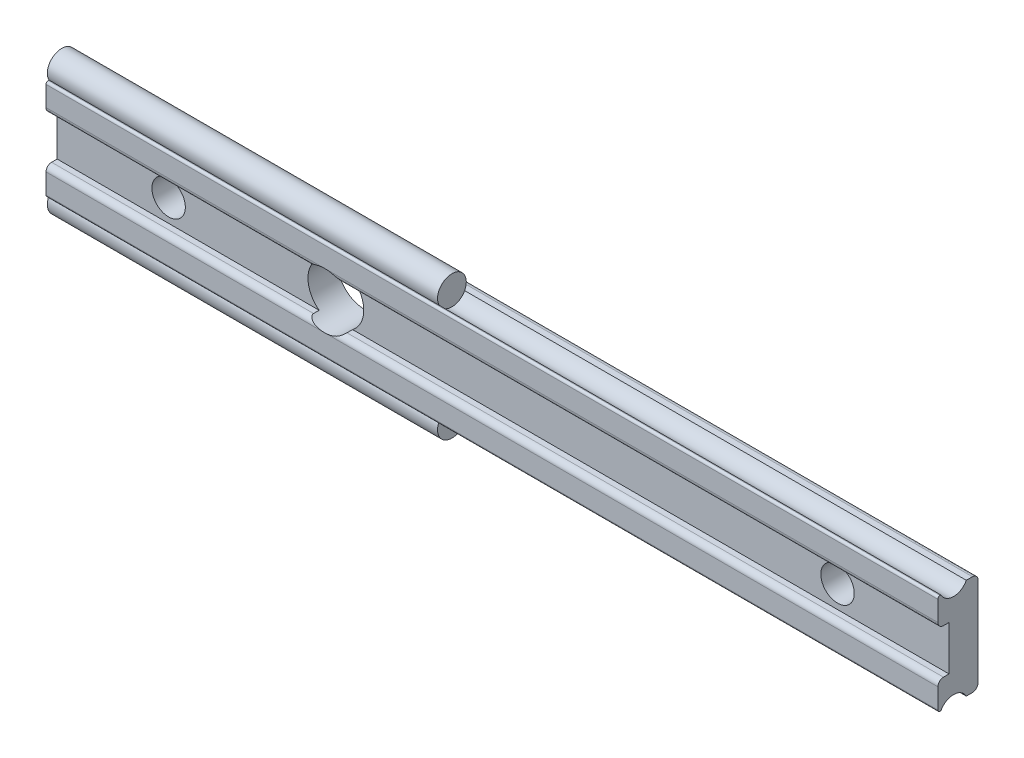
ISO-10303-21;
HEADER;
FILE_DESCRIPTION(('STEP AP214'),'2;1');
FILE_NAME('part.step','',(''),(''),'','','');
FILE_SCHEMA(('AUTOMOTIVE_DESIGN { 1 0 10303 214 1 1 1 1 }'));
ENDSEC;
DATA;
#1=APPLICATION_CONTEXT('core data for automotive mechanical design processes');
#2=APPLICATION_PROTOCOL_DEFINITION('international standard','automotive_design',2000,#1);
#3=PRODUCT_CONTEXT('',#1,'mechanical');
#4=PRODUCT('Part','Part','',(#3));
#5=PRODUCT_RELATED_PRODUCT_CATEGORY('part','',(#4));
#6=PRODUCT_DEFINITION_FORMATION('','',#4);
#7=PRODUCT_DEFINITION_CONTEXT('part definition',#1,'design');
#8=PRODUCT_DEFINITION('design','',#6,#7);
#9=PRODUCT_DEFINITION_SHAPE('','',#8);
#10=(LENGTH_UNIT() NAMED_UNIT(*) SI_UNIT(.MILLI.,.METRE.));
#11=(NAMED_UNIT(*) PLANE_ANGLE_UNIT() SI_UNIT($,.RADIAN.));
#12=(NAMED_UNIT(*) SI_UNIT($,.STERADIAN.) SOLID_ANGLE_UNIT());
#13=UNCERTAINTY_MEASURE_WITH_UNIT(LENGTH_MEASURE(1.E-05),#10,'distance_accuracy_value','');
#14=(GEOMETRIC_REPRESENTATION_CONTEXT(3) GLOBAL_UNCERTAINTY_ASSIGNED_CONTEXT((#13)) GLOBAL_UNIT_ASSIGNED_CONTEXT((#10,
#11,#12)) REPRESENTATION_CONTEXT('',''));
#15=CARTESIAN_POINT('',(0.,0.,0.));
#16=DIRECTION('',(0.,0.,1.));
#17=DIRECTION('',(1.,0.,0.));
#18=AXIS2_PLACEMENT_3D('',#15,#16,#17);
#19=CARTESIAN_POINT('',(-10.,-5.10000002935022,2.18999997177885));
#20=DIRECTION('',(1.,0.,0.));
#21=DIRECTION('',(0.,0.,-1.));
#22=AXIS2_PLACEMENT_3D('',#19,#20,#21);
#23=CYLINDRICAL_SURFACE('',#22,1.28999999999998);
#24=DIRECTION('',(1.,0.,0.));
#25=VECTOR('',#24,1.);
#26=CARTESIAN_POINT('',(-10.,-4.50000002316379,3.33197194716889));
#27=LINE('',#26,#25);
#28=CARTESIAN_POINT('',(25.,-4.50000002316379,3.33197194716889));
#29=VERTEX_POINT('',#28);
#30=CARTESIAN_POINT('',(70.,-4.50000002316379,3.33197194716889));
#31=VERTEX_POINT('',#30);
#32=EDGE_CURVE('E36',#29,#31,#27,.T.);
#33=ORIENTED_EDGE('',*,*,#32,.F.);
#34=CARTESIAN_POINT('',(25.,-5.10000002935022,2.18999997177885));
#35=DIRECTION('',(-1.,0.,0.));
#36=DIRECTION('',(0.,0.,1.));
#37=AXIS2_PLACEMENT_3D('',#34,#35,#36);
#38=CIRCLE('',#37,1.28999999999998);
#39=CARTESIAN_POINT('',(25.,-4.50000002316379,1.04802799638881));
#40=VERTEX_POINT('',#39);
#41=EDGE_CURVE('E31',#29,#40,#38,.T.);
#42=ORIENTED_EDGE('',*,*,#41,.T.);
#43=DIRECTION('',(1.,0.,0.));
#44=VECTOR('',#43,1.);
#45=CARTESIAN_POINT('',(-10.,-4.50000002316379,1.04802799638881));
#46=LINE('',#45,#44);
#47=CARTESIAN_POINT('',(70.,-4.50000002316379,1.04802799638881));
#48=VERTEX_POINT('',#47);
#49=EDGE_CURVE('E199',#40,#48,#46,.T.);
#50=ORIENTED_EDGE('',*,*,#49,.T.);
#51=CARTESIAN_POINT('',(70.,-5.10000002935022,2.18999997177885));
#52=DIRECTION('',(-1.,0.,0.));
#53=DIRECTION('',(0.,0.,1.));
#54=AXIS2_PLACEMENT_3D('',#51,#52,#53);
#55=CIRCLE('',#54,1.28999999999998);
#56=EDGE_CURVE('E343',#31,#48,#55,.T.);
#57=ORIENTED_EDGE('',*,*,#56,.F.);
#58=EDGE_LOOP('',(#33,#42,#50,#57));
#59=FACE_BOUND('',#58,.T.);
#60=ADVANCED_FACE('F14',(#59),#23,.F.);
#61=CARTESIAN_POINT('',(-10.,5.10000002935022,2.18999997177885));
#62=DIRECTION('',(1.,0.,0.));
#63=DIRECTION('',(0.,0.,-1.));
#64=AXIS2_PLACEMENT_3D('',#61,#62,#63);
#65=CYLINDRICAL_SURFACE('',#64,1.28999999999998);
#66=DIRECTION('',(1.,0.,0.));
#67=VECTOR('',#66,1.);
#68=CARTESIAN_POINT('',(-10.,4.50000002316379,1.04802799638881));
#69=LINE('',#68,#67);
#70=CARTESIAN_POINT('',(25.,4.50000002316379,1.04802799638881));
#71=VERTEX_POINT('',#70);
#72=CARTESIAN_POINT('',(70.,4.50000002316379,1.04802799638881));
#73=VERTEX_POINT('',#72);
#74=EDGE_CURVE('E434',#71,#73,#69,.T.);
#75=ORIENTED_EDGE('',*,*,#74,.F.);
#76=CARTESIAN_POINT('',(25.,5.10000002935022,2.18999997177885));
#77=DIRECTION('',(-1.,0.,0.));
#78=DIRECTION('',(0.,0.,1.));
#79=AXIS2_PLACEMENT_3D('',#76,#77,#78);
#80=CIRCLE('',#79,1.28999999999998);
#81=CARTESIAN_POINT('',(25.,4.50000002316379,3.33197194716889));
#82=VERTEX_POINT('',#81);
#83=EDGE_CURVE('E215',#71,#82,#80,.T.);
#84=ORIENTED_EDGE('',*,*,#83,.T.);
#85=DIRECTION('',(1.,0.,0.));
#86=VECTOR('',#85,1.);
#87=CARTESIAN_POINT('',(-10.,4.50000002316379,3.33197194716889));
#88=LINE('',#87,#86);
#89=CARTESIAN_POINT('',(70.,4.50000002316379,3.33197194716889));
#90=VERTEX_POINT('',#89);
#91=EDGE_CURVE('E431',#82,#90,#88,.T.);
#92=ORIENTED_EDGE('',*,*,#91,.T.);
#93=CARTESIAN_POINT('',(70.,5.10000002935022,2.18999997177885));
#94=DIRECTION('',(-1.,0.,0.));
#95=DIRECTION('',(0.,0.,-1.));
#96=AXIS2_PLACEMENT_3D('',#93,#94,#95);
#97=CIRCLE('',#96,1.28999999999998);
#98=EDGE_CURVE('E446',#73,#90,#97,.T.);
#99=ORIENTED_EDGE('',*,*,#98,.F.);
#100=EDGE_LOOP('',(#75,#84,#92,#99));
#101=FACE_BOUND('',#100,.T.);
#102=ADVANCED_FACE('F296',(#101),#65,.F.);
#103=CARTESIAN_POINT('',(-10.,-2.50000002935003,3.0999999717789));
#104=DIRECTION('',(1.,0.,0.));
#105=DIRECTION('',(0.,0.,-1.));
#106=AXIS2_PLACEMENT_3D('',#103,#104,#105);
#107=CYLINDRICAL_SURFACE('',#106,0.5);
#108=CARTESIAN_POINT('',(13.5000000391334,-2.00000002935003,3.0999999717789));
#109=CARTESIAN_POINT('',(13.4999623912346,-1.99996207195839,3.11987287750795));
#110=CARTESIAN_POINT('',(13.5015761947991,-2.00118249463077,3.13968780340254));
#111=CARTESIAN_POINT('',(13.5077735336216,-2.00581273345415,3.17838692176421));
#112=CARTESIAN_POINT('',(13.5123272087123,-2.00920053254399,3.19727844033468));
#113=CARTESIAN_POINT('',(13.524064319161,-2.01783620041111,3.23368112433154));
#114=CARTESIAN_POINT('',(13.5312395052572,-2.02307823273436,3.25119641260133));
#115=CARTESIAN_POINT('',(13.5478060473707,-2.03500322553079,3.28464478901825));
#116=CARTESIAN_POINT('',(13.5572029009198,-2.04168975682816,3.30057381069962));
#117=CARTESIAN_POINT('',(13.5821801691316,-2.05915126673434,3.33710629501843));
#118=CARTESIAN_POINT('',(13.5986909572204,-2.07045578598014,3.35681757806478));
#119=CARTESIAN_POINT('',(13.6343735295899,-2.09416519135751,3.39285662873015));
#120=CARTESIAN_POINT('',(13.6535504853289,-2.10657219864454,3.40917766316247));
#121=CARTESIAN_POINT('',(13.7057779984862,-2.13925431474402,3.44760067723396));
#122=CARTESIAN_POINT('',(13.7403171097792,-2.15983620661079,3.46739923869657));
#123=CARTESIAN_POINT('',(13.8124646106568,-2.20033841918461,3.50112098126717));
#124=CARTESIAN_POINT('',(13.8500797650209,-2.22025713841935,3.51503077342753));
#125=CARTESIAN_POINT('',(13.9246423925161,-2.25725862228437,3.53761969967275));
#126=CARTESIAN_POINT('',(13.9614526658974,-2.27444229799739,3.54659655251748));
#127=CARTESIAN_POINT('',(14.036377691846,-2.30718587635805,3.56167921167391));
#128=CARTESIAN_POINT('',(14.0744935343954,-2.32274437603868,3.56778255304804));
#129=CARTESIAN_POINT('',(14.1517657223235,-2.35206511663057,3.57786589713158));
#130=CARTESIAN_POINT('',(14.1909240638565,-2.36582356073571,3.5818414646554));
#131=CARTESIAN_POINT('',(14.2699963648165,-2.39140610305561,3.58824225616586));
#132=CARTESIAN_POINT('',(14.3099105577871,-2.40322959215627,3.59066699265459));
#133=CARTESIAN_POINT('',(14.4163047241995,-2.43187057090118,3.59567017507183));
#134=CARTESIAN_POINT('',(14.4832923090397,-2.44698126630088,3.59733638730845));
#135=CARTESIAN_POINT('',(14.6183198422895,-2.47164651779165,3.59934733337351));
#136=CARTESIAN_POINT('',(14.6863603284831,-2.48119813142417,3.59969136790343));
#137=CARTESIAN_POINT('',(14.8231051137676,-2.49468127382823,3.60001763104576));
#138=CARTESIAN_POINT('',(14.8918102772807,-2.49860408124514,3.59999929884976));
#139=CARTESIAN_POINT('',(15.0292885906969,-2.50077334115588,3.60000045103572));
#140=CARTESIAN_POINT('',(15.0980617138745,-2.49902150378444,3.60001992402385));
#141=CARTESIAN_POINT('',(15.2361894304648,-2.48979369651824,3.59991747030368));
#142=CARTESIAN_POINT('',(15.3055387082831,-2.48223803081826,3.59979356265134));
#143=CARTESIAN_POINT('',(15.4434132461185,-2.46135084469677,3.59861400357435));
#144=CARTESIAN_POINT('',(15.5119378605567,-2.44801506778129,3.5975576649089));
#145=CARTESIAN_POINT('',(15.647193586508,-2.41577094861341,3.59312171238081));
#146=CARTESIAN_POINT('',(15.7139325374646,-2.39689392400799,3.58975501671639));
#147=CARTESIAN_POINT('',(15.8452354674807,-2.35378973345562,3.57866700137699));
#148=CARTESIAN_POINT('',(15.9098033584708,-2.32957285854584,3.57095401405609));
#149=CARTESIAN_POINT('',(16.0068972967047,-2.28856748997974,3.55336413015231));
#150=CARTESIAN_POINT('',(16.0405930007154,-2.27343563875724,3.54608306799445));
#151=CARTESIAN_POINT('',(16.1067254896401,-2.24198497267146,3.5286641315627));
#152=CARTESIAN_POINT('',(16.1391613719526,-2.22566533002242,3.51852425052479));
#153=CARTESIAN_POINT('',(16.2024883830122,-2.19210294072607,3.49449855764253));
#154=CARTESIAN_POINT('',(16.233366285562,-2.17485425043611,3.48058554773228));
#155=CARTESIAN_POINT('',(16.2924927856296,-2.14023972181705,3.44804575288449));
#156=CARTESIAN_POINT('',(16.3207460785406,-2.12287415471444,3.42942761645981));
#157=CARTESIAN_POINT('',(16.3636912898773,-2.0954098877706,3.394287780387));
#158=CARTESIAN_POINT('',(16.3795669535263,-2.08497392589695,3.37948471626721));
#159=CARTESIAN_POINT('',(16.4092206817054,-2.06504577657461,3.34732961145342));
#160=CARTESIAN_POINT('',(16.4230004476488,-2.0555528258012,3.32997966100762));
#161=CARTESIAN_POINT('',(16.4458455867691,-2.03953296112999,3.29562678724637));
#162=CARTESIAN_POINT('',(16.4553118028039,-2.03277439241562,3.27900168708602));
#163=CARTESIAN_POINT('',(16.4718168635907,-2.02085580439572,3.24408352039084));
#164=CARTESIAN_POINT('',(16.4788617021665,-2.01569184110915,3.22579471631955));
#165=CARTESIAN_POINT('',(16.4895121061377,-2.00783357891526,3.18984795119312));
#166=CARTESIAN_POINT('',(16.4933960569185,-2.00494048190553,3.17231727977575));
#167=CARTESIAN_POINT('',(16.4986638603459,-2.0010022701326,3.13654134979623));
#168=CARTESIAN_POINT('',(16.5000272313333,-1.99997229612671,3.11829145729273));
#169=CARTESIAN_POINT('',(16.4999999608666,-2.00000002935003,3.0999999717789));
#170=B_SPLINE_CURVE_WITH_KNOTS('',3,(#108,#109,#110,#111,#112,#113,#114,#115,#116,#117,#118,
#119,#120,#121,#122,#123,#124,#125,#126,#127,#128,#129,#130,#131,#132,#133,#134,#135,#136,#137,
#138,#139,#140,#141,#142,#143,#144,#145,#146,#147,#148,#149,#150,#151,#152,#153,#154,#155,#156,
#157,#158,#159,#160,#161,#162,#163,#164,#165,#166,#167,#168,#169),.UNSPECIFIED.,.F.,.F.,(4,2,2,
2,2,2,2,2,2,2,2,2,2,2,2,2,2,2,2,2,2,2,2,2,2,2,2,2,2,2,4),(0.,0.0594240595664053,
0.11825384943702,0.176900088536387,0.23569299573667,0.319483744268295,0.403439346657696,
0.537132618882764,0.671128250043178,0.79575517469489,0.920488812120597,1.0454814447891,
1.17051334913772,1.37630111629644,1.58219770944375,1.78841297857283,1.99456610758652,
2.20360179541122,2.41279168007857,2.62082132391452,2.82845350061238,2.94128618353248,
3.05419826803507,3.16794695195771,3.2814880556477,3.35355275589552,3.42555863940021,
3.48619419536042,3.5466785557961,3.60096706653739,3.65569480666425),.UNSPECIFIED.);
#171=CARTESIAN_POINT('',(13.5000000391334,-2.00000002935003,3.0999999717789));
#172=VERTEX_POINT('',#171);
#173=CARTESIAN_POINT('',(15.,-2.50000002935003,3.5999999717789));
#174=VERTEX_POINT('',#173);
#175=EDGE_CURVE('E258',#172,#174,#170,.T.);
#176=ORIENTED_EDGE('',*,*,#175,.F.);
#177=DIRECTION('',(1.,0.,0.));
#178=VECTOR('',#177,1.);
#179=CARTESIAN_POINT('',(-10.,-2.00000002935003,3.0999999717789));
#180=LINE('',#179,#178);
#181=CARTESIAN_POINT('',(-10.,-2.00000002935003,3.0999999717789));
#182=VERTEX_POINT('',#181);
#183=EDGE_CURVE('E404',#182,#172,#180,.T.);
#184=ORIENTED_EDGE('',*,*,#183,.F.);
#185=CARTESIAN_POINT('',(-10.,-2.50000002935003,3.0999999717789));
#186=DIRECTION('',(1.,0.,0.));
#187=DIRECTION('',(0.,0.,1.));
#188=AXIS2_PLACEMENT_3D('',#185,#186,#187);
#189=CIRCLE('',#188,0.5);
#190=CARTESIAN_POINT('',(-10.,-2.50000002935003,3.5999999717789));
#191=VERTEX_POINT('',#190);
#192=EDGE_CURVE('E381',#182,#191,#189,.T.);
#193=ORIENTED_EDGE('',*,*,#192,.T.);
#194=DIRECTION('',(1.,0.,0.));
#195=VECTOR('',#194,1.);
#196=CARTESIAN_POINT('',(-10.,-2.50000002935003,3.5999999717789));
#197=LINE('',#196,#195);
#198=EDGE_CURVE('E400',#191,#174,#197,.T.);
#199=ORIENTED_EDGE('',*,*,#198,.T.);
#200=EDGE_LOOP('',(#176,#184,#193,#199));
#201=FACE_BOUND('',#200,.T.);
#202=ADVANCED_FACE('F271',(#201),#107,.T.);
#203=CARTESIAN_POINT('',(-10.,-2.00000002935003,3.0999999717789));
#204=DIRECTION('',(0.,1.,0.));
#205=DIRECTION('',(1.,0.,0.));
#206=AXIS2_PLACEMENT_3D('',#203,#204,#205);
#207=PLANE('',#206);
#208=DIRECTION('',(0.,0.,-1.));
#209=VECTOR('',#208,1.);
#210=CARTESIAN_POINT('',(16.4999999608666,-2.00000002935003,3.5999999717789));
#211=LINE('',#210,#209);
#212=CARTESIAN_POINT('',(16.4999999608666,-2.00000002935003,3.0999999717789));
#213=VERTEX_POINT('',#212);
#214=CARTESIAN_POINT('',(16.4999999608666,-2.00000002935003,2.59999996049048));
#215=VERTEX_POINT('',#214);
#216=EDGE_CURVE('E259',#213,#215,#211,.T.);
#217=ORIENTED_EDGE('',*,*,#216,.F.);
#218=CARTESIAN_POINT('',(70.,-2.00000002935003,3.0999999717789));
#219=VERTEX_POINT('',#218);
#220=EDGE_CURVE('E407',#213,#219,#180,.T.);
#221=ORIENTED_EDGE('',*,*,#220,.T.);
#222=DIRECTION('',(0.,0.,1.));
#223=VECTOR('',#222,1.);
#224=CARTESIAN_POINT('',(70.,-2.00000002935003,3.0999999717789));
#225=LINE('',#224,#223);
#226=CARTESIAN_POINT('',(70.,-2.00000002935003,2.59999996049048));
#227=VERTEX_POINT('',#226);
#228=EDGE_CURVE('E338',#227,#219,#225,.T.);
#229=ORIENTED_EDGE('',*,*,#228,.F.);
#230=DIRECTION('',(1.,0.,0.));
#231=VECTOR('',#230,1.);
#232=CARTESIAN_POINT('',(-10.,-2.00000002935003,2.59999996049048));
#233=LINE('',#232,#231);
#234=EDGE_CURVE('E411',#215,#227,#233,.T.);
#235=ORIENTED_EDGE('',*,*,#234,.F.);
#236=EDGE_LOOP('',(#217,#221,#229,#235));
#237=FACE_BOUND('',#236,.T.);
#238=ADVANCED_FACE('F277',(#237),#207,.T.);
#239=CARTESIAN_POINT('',(-10.,-2.00000002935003,2.59999996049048));
#240=DIRECTION('',(0.,0.,1.));
#241=DIRECTION('',(1.,0.,0.));
#242=AXIS2_PLACEMENT_3D('',#239,#240,#241);
#243=PLANE('',#242);
#244=CARTESIAN_POINT('',(0.,0.,2.59999996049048));
#245=DIRECTION('',(0.,0.,1.));
#246=DIRECTION('',(1.,0.,0.));
#247=AXIS2_PLACEMENT_3D('',#244,#245,#246);
#248=CIRCLE('',#247,1.5);
#249=CARTESIAN_POINT('',(1.5,0.,2.59999996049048));
#250=VERTEX_POINT('',#249);
#251=EDGE_CURVE('E716',#250,#250,#248,.T.);
#252=ORIENTED_EDGE('',*,*,#251,.F.);
#253=EDGE_LOOP('',(#252));
#254=FACE_BOUND('',#253,.T.);
#255=CARTESIAN_POINT('',(15.,0.,2.59999996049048));
#256=DIRECTION('',(0.,0.,1.));
#257=DIRECTION('',(1.,0.,0.));
#258=AXIS2_PLACEMENT_3D('',#255,#256,#257);
#259=CIRCLE('',#258,2.5);
#260=CARTESIAN_POINT('',(13.5000000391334,2.00000002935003,2.59999996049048));
#261=VERTEX_POINT('',#260);
#262=CARTESIAN_POINT('',(13.5000000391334,-2.00000002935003,2.59999996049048));
#263=VERTEX_POINT('',#262);
#264=EDGE_CURVE('E485',#261,#263,#259,.T.);
#265=ORIENTED_EDGE('',*,*,#264,.F.);
#266=DIRECTION('',(1.,0.,0.));
#267=VECTOR('',#266,1.);
#268=CARTESIAN_POINT('',(-10.,2.00000002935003,2.59999996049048));
#269=LINE('',#268,#267);
#270=CARTESIAN_POINT('',(-10.,2.00000002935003,2.59999996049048));
#271=VERTEX_POINT('',#270);
#272=EDGE_CURVE('E412',#271,#261,#269,.T.);
#273=ORIENTED_EDGE('',*,*,#272,.F.);
#274=DIRECTION('',(0.,-1.,0.));
#275=VECTOR('',#274,1.);
#276=CARTESIAN_POINT('',(-10.,-2.00000002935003,2.59999996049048));
#277=LINE('',#276,#275);
#278=CARTESIAN_POINT('',(-10.,-2.00000002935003,2.59999996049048));
#279=VERTEX_POINT('',#278);
#280=EDGE_CURVE('E375',#271,#279,#277,.T.);
#281=ORIENTED_EDGE('',*,*,#280,.T.);
#282=EDGE_CURVE('E408',#279,#263,#233,.T.);
#283=ORIENTED_EDGE('',*,*,#282,.T.);
#284=EDGE_LOOP('',(#265,#273,#281,#283));
#285=FACE_BOUND('',#284,.T.);
#286=ADVANCED_FACE('F281',(#254,#285),#243,.T.);
#287=CARTESIAN_POINT('',(-10.,2.00000002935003,3.0999999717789));
#288=DIRECTION('',(0.,-1.,0.));
#289=DIRECTION('',(-1.,0.,0.));
#290=AXIS2_PLACEMENT_3D('',#287,#288,#289);
#291=PLANE('',#290);
#292=DIRECTION('',(0.,0.,-1.));
#293=VECTOR('',#292,1.);
#294=CARTESIAN_POINT('',(13.5000000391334,2.00000002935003,3.5999999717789));
#295=LINE('',#294,#293);
#296=CARTESIAN_POINT('',(13.500000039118,2.00000002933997,3.09999997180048));
#297=VERTEX_POINT('',#296);
#298=EDGE_CURVE('E489',#297,#261,#295,.T.);
#299=ORIENTED_EDGE('',*,*,#298,.F.);
#300=DIRECTION('',(1.,0.,0.));
#301=VECTOR('',#300,1.);
#302=CARTESIAN_POINT('',(-10.,2.00000002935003,3.0999999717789));
#303=LINE('',#302,#301);
#304=CARTESIAN_POINT('',(-10.,2.00000002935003,3.0999999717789));
#305=VERTEX_POINT('',#304);
#306=EDGE_CURVE('E416',#305,#297,#303,.T.);
#307=ORIENTED_EDGE('',*,*,#306,.F.);
#308=DIRECTION('',(0.,0.,-1.));
#309=VECTOR('',#308,1.);
#310=CARTESIAN_POINT('',(-10.,2.00000002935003,3.0999999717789));
#311=LINE('',#310,#309);
#312=EDGE_CURVE('E372',#305,#271,#311,.T.);
#313=ORIENTED_EDGE('',*,*,#312,.T.);
#314=ORIENTED_EDGE('',*,*,#272,.T.);
#315=EDGE_LOOP('',(#299,#307,#313,#314));
#316=FACE_BOUND('',#315,.T.);
#317=ADVANCED_FACE('F284',(#316),#291,.T.);
#318=CARTESIAN_POINT('',(-10.,2.50000002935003,3.0999999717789));
#319=DIRECTION('',(1.,0.,0.));
#320=DIRECTION('',(0.,0.,-1.));
#321=AXIS2_PLACEMENT_3D('',#318,#319,#320);
#322=CYLINDRICAL_SURFACE('',#321,0.5);
#323=CARTESIAN_POINT('',(15.,2.50000002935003,2.5999999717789));
#324=CARTESIAN_POINT('',(15.069780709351,2.49999961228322,2.59999684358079));
#325=CARTESIAN_POINT('',(15.1395723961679,2.49707593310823,2.59997347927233));
#326=CARTESIAN_POINT('',(15.2787151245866,2.48539690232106,2.6001800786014));
#327=CARTESIAN_POINT('',(15.348065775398,2.47663695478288,2.60041024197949));
#328=CARTESIAN_POINT('',(15.4859229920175,2.45331869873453,2.60204582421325));
#329=CARTESIAN_POINT('',(15.5544276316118,2.43874903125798,2.60345355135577));
#330=CARTESIAN_POINT('',(15.6898082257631,2.40396478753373,2.60899333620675));
#331=CARTESIAN_POINT('',(15.756685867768,2.38375635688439,2.61312243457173));
#332=CARTESIAN_POINT('',(15.8878611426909,2.33805107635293,2.62635222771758));
#333=CARTESIAN_POINT('',(15.9521694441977,2.31257958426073,2.6354294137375));
#334=CARTESIAN_POINT('',(16.0456684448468,2.2710659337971,2.65523231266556));
#335=CARTESIAN_POINT('',(16.0762719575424,2.25671479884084,2.66283922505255));
#336=CARTESIAN_POINT('',(16.1362469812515,2.22711837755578,2.68067268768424));
#337=CARTESIAN_POINT('',(16.1656196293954,2.21187394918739,2.69089675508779));
#338=CARTESIAN_POINT('',(16.2198533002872,2.18238701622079,2.71343738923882));
#339=CARTESIAN_POINT('',(16.2448711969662,2.16819760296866,2.72544077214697));
#340=CARTESIAN_POINT('',(16.2931470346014,2.13975590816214,2.75270629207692));
#341=CARTESIAN_POINT('',(16.3164016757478,2.12550355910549,2.76797434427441));
#342=CARTESIAN_POINT('',(16.3606798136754,2.09743792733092,2.80259720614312));
#343=CARTESIAN_POINT('',(16.3816675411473,2.08363357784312,2.82200620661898));
#344=CARTESIAN_POINT('',(16.4198250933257,2.05782015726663,2.86525768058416));
#345=CARTESIAN_POINT('',(16.4370109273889,2.04580363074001,2.88908075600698));
#346=CARTESIAN_POINT('',(16.4601638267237,2.02929472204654,2.93054582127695));
#347=CARTESIAN_POINT('',(16.4678583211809,2.02372383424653,2.9467969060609));
#348=CARTESIAN_POINT('',(16.4809806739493,2.01414052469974,2.98063213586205));
#349=CARTESIAN_POINT('',(16.4864099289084,2.01012714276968,2.99821545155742));
#350=CARTESIAN_POINT('',(16.4946932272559,2.00397599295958,3.03443077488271));
#351=CARTESIAN_POINT('',(16.4975302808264,2.00185060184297,3.0530688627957));
#352=CARTESIAN_POINT('',(16.5003573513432,1.99973280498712,3.09067994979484));
#353=CARTESIAN_POINT('',(16.5003484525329,1.99973958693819,3.10965281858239));
#354=CARTESIAN_POINT('',(16.497624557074,2.00177987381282,3.14547864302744));
#355=CARTESIAN_POINT('',(16.4951642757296,2.00362260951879,3.16236308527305));
#356=CARTESIAN_POINT('',(16.4880645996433,2.00890097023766,3.195403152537));
#357=CARTESIAN_POINT('',(16.4834248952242,2.01233682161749,3.21155867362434));
#358=CARTESIAN_POINT('',(16.4720098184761,2.02070243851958,3.2433670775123));
#359=CARTESIAN_POINT('',(16.465164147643,2.02568113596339,3.2589814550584));
#360=CARTESIAN_POINT('',(16.4497114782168,2.03676887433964,3.28886889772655));
#361=CARTESIAN_POINT('',(16.4411036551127,2.04287844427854,3.30314133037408));
#362=CARTESIAN_POINT('',(16.4169435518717,2.05975585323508,3.33823463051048));
#363=CARTESIAN_POINT('',(16.4002789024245,2.07115448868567,3.35798793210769));
#364=CARTESIAN_POINT('',(16.3642668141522,2.09505326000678,3.39409026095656));
#365=CARTESIAN_POINT('',(16.3449122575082,2.10755628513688,3.4104299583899));
#366=CARTESIAN_POINT('',(16.2922096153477,2.14047625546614,3.44887366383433));
#367=CARTESIAN_POINT('',(16.2573666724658,2.16119156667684,3.46865418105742));
#368=CARTESIAN_POINT('',(16.1846096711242,2.20192103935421,3.50230255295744));
#369=CARTESIAN_POINT('',(16.1466891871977,2.22193360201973,3.51615763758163));
#370=CARTESIAN_POINT('',(16.0714819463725,2.25910706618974,3.53864276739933));
#371=CARTESIAN_POINT('',(16.0343299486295,2.27636940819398,3.54756588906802));
#372=CARTESIAN_POINT('',(15.9587172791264,2.30923445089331,3.56253063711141));
#373=CARTESIAN_POINT('',(15.9202555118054,2.32483571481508,3.5685697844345));
#374=CARTESIAN_POINT('',(15.8422841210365,2.35420842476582,3.57852429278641));
#375=CARTESIAN_POINT('',(15.8027723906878,2.36797579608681,3.5824349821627));
#376=CARTESIAN_POINT('',(15.7229920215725,2.39354107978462,3.58871158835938));
#377=CARTESIAN_POINT('',(15.682723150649,2.40533837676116,3.59107702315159));
#378=CARTESIAN_POINT('',(15.5757687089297,2.43376380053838,3.59591989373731));
#379=CARTESIAN_POINT('',(15.5085845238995,2.44868671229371,3.59751014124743));
#380=CARTESIAN_POINT('',(15.373180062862,2.47294830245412,3.59941453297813));
#381=CARTESIAN_POINT('',(15.3049592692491,2.48228409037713,3.59972801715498));
#382=CARTESIAN_POINT('',(15.1679315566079,2.49530310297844,3.60002072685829));
#383=CARTESIAN_POINT('',(15.0991242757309,2.49898253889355,3.59999972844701));
#384=CARTESIAN_POINT('',(14.9614619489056,2.50065037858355,3.60000014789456));
#385=CARTESIAN_POINT('',(14.892606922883,2.49864045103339,3.6000215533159));
#386=CARTESIAN_POINT('',(14.7545108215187,2.48889147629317,3.59990066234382));
#387=CARTESIAN_POINT('',(14.6852743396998,2.4810871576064,3.59975649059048));
#388=CARTESIAN_POINT('',(14.5476490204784,2.45972182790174,3.59849012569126));
#389=CARTESIAN_POINT('',(14.4792608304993,2.44615666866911,3.59736722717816));
#390=CARTESIAN_POINT('',(14.3439854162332,2.41339584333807,3.59272083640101));
#391=CARTESIAN_POINT('',(14.2770966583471,2.39420624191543,3.58919992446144));
#392=CARTESIAN_POINT('',(14.1455781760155,2.35047976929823,3.5776581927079));
#393=CARTESIAN_POINT('',(14.0809445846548,2.32595263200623,3.56964552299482));
#394=CARTESIAN_POINT('',(13.9614239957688,2.27488794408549,3.54724040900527));
#395=CARTESIAN_POINT('',(13.9062176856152,2.24881546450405,3.53358757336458));
#396=CARTESIAN_POINT('',(13.8269591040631,2.20790883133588,3.5061351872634));
#397=CARTESIAN_POINT('',(13.8012028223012,2.19401762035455,3.49586302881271));
#398=CARTESIAN_POINT('',(13.7511989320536,2.16594371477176,3.47247956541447));
#399=CARTESIAN_POINT('',(13.7269491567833,2.15176147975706,3.45937246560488));
#400=CARTESIAN_POINT('',(13.6853213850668,2.12651940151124,3.4328267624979));
#401=CARTESIAN_POINT('',(13.6675631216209,2.11542361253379,3.42002403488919));
#402=CARTESIAN_POINT('',(13.6336986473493,2.09371073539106,3.39196563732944));
#403=CARTESIAN_POINT('',(13.617594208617,2.08309416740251,3.37670738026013));
#404=CARTESIAN_POINT('',(13.5874473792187,2.06277214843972,3.34334601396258));
#405=CARTESIAN_POINT('',(13.5734283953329,2.05307742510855,3.32521473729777));
#406=CARTESIAN_POINT('',(13.548421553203,2.03547394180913,3.28619898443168));
#407=CARTESIAN_POINT('',(13.5374266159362,2.02756101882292,3.26532111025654));
#408=CARTESIAN_POINT('',(13.5218205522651,2.01619736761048,3.22732618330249));
#409=CARTESIAN_POINT('',(13.5162844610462,2.01211769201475,3.21077709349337));
#410=CARTESIAN_POINT('',(13.5075194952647,2.00562509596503,3.17676126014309));
#411=CARTESIAN_POINT('',(13.5042891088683,2.0032110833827,3.15929512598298));
#412=CARTESIAN_POINT('',(13.5003337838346,2.00025191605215,3.12385463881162));
#413=CARTESIAN_POINT('',(13.4996181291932,1.99971368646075,3.10587864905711));
#414=CARTESIAN_POINT('',(13.5007681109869,2.00057596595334,3.0700567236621));
#415=CARTESIAN_POINT('',(13.5026338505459,2.00197655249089,3.05221079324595));
#416=CARTESIAN_POINT('',(13.5086526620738,2.00646351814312,3.01813721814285));
#417=CARTESIAN_POINT('',(13.5126783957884,2.00945597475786,3.0018740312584));
#418=CARTESIAN_POINT('',(13.5227062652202,2.01683957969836,2.97031120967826));
#419=CARTESIAN_POINT('',(13.5287090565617,2.02123119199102,2.95501189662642));
#420=CARTESIAN_POINT('',(13.5449788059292,2.03298963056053,2.92012689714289));
#421=CARTESIAN_POINT('',(13.5560014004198,2.04085558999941,2.9010618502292));
#422=CARTESIAN_POINT('',(13.5805769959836,2.0580243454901,2.86536857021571));
#423=CARTESIAN_POINT('',(13.5941350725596,2.06733001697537,2.84874534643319));
#424=CARTESIAN_POINT('',(13.6299444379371,2.09131494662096,2.81070475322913));
#425=CARTESIAN_POINT('',(13.6533074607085,2.10648162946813,2.79064977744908));
#426=CARTESIAN_POINT('',(13.7028534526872,2.13735094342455,2.75497203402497));
#427=CARTESIAN_POINT('',(13.7290417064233,2.15305454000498,2.7393577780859));
#428=CARTESIAN_POINT('',(13.7795657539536,2.18203276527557,2.71371523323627));
#429=CARTESIAN_POINT('',(13.8036475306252,2.19533963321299,2.70321093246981));
#430=CARTESIAN_POINT('',(13.8529228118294,2.2214847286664,2.68444296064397));
#431=CARTESIAN_POINT('',(13.8781171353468,2.23432259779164,2.67618097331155));
#432=CARTESIAN_POINT('',(13.955087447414,2.27187370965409,2.65412013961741));
#433=CARTESIAN_POINT('',(14.0081550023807,2.29556896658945,2.64309056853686));
#434=CARTESIAN_POINT('',(14.1139956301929,2.33840201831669,2.62630514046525));
#435=CARTESIAN_POINT('',(14.1666763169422,2.35769592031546,2.620336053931));
#436=CARTESIAN_POINT('',(14.2734821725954,2.39276663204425,2.61129875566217));
#437=CARTESIAN_POINT('',(14.3276086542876,2.40854011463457,2.60823327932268));
#438=CARTESIAN_POINT('',(14.4368305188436,2.4363942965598,2.60386249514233));
#439=CARTESIAN_POINT('',(14.4919253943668,2.44847687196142,2.60255629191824));
#440=CARTESIAN_POINT('',(14.6027870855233,2.46888568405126,2.60086397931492));
#441=CARTESIAN_POINT('',(14.6585535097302,2.4772140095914,2.60047735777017));
#442=CARTESIAN_POINT('',(14.7619103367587,2.48909375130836,2.60008975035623));
#443=CARTESIAN_POINT('',(14.8094395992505,2.49318272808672,2.60003861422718));
#444=CARTESIAN_POINT('',(14.9046442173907,2.49863577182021,2.59999479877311));
#445=CARTESIAN_POINT('',(14.9523195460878,2.50000031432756,2.60000210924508));
#446=CARTESIAN_POINT('',(15.,2.50000002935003,2.5999999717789));
#447=B_SPLINE_CURVE_WITH_KNOTS('',3,(#323,#324,#325,#326,#327,#328,#329,#330,#331,#332,#333,
#334,#335,#336,#337,#338,#339,#340,#341,#342,#343,#344,#345,#346,#347,#348,#349,#350,#351,#352,
#353,#354,#355,#356,#357,#358,#359,#360,#361,#362,#363,#364,#365,#366,#367,#368,#369,#370,#371,
#372,#373,#374,#375,#376,#377,#378,#379,#380,#381,#382,#383,#384,#385,#386,#387,#388,#389,#390,
#391,#392,#393,#394,#395,#396,#397,#398,#399,#400,#401,#402,#403,#404,#405,#406,#407,#408,#409,
#410,#411,#412,#413,#414,#415,#416,#417,#418,#419,#420,#421,#422,#423,#424,#425,#426,#427,#428,
#429,#430,#431,#432,#433,#434,#435,#436,#437,#438,#439,#440,#441,#442,#443,#444,#445,#446),
.UNSPECIFIED.,.T.,.F.,(4,2,2,2,2,2,2,2,2,2,2,2,2,2,2,2,2,2,2,2,2,2,2,2,2,2,2,2,2,2,2,2,2,2,2,2,
2,2,2,2,2,2,2,2,2,2,2,2,2,2,2,2,2,2,2,2,2,2,2,2,2,4),(0.,0.209299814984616,0.418764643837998,
0.628641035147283,0.838289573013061,1.04695062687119,1.1507910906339,1.25453340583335,
1.34785907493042,1.44135529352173,1.53615966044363,1.63055687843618,1.68681937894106,
1.7430471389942,1.7996408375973,1.85621297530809,1.9074618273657,1.95871796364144,
2.01180304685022,2.06491302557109,2.14916554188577,2.23364540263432,2.36819630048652,
2.50303572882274,2.62863165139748,2.75433534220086,2.88031383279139,3.00633160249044,
3.21256676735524,3.41890853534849,3.62538845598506,3.83180782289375,4.04058838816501,
4.24951954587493,4.45822624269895,4.66655547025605,4.85349204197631,4.94640888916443,
5.03918884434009,5.11267285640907,5.18623480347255,5.26056853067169,5.33472673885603,
5.38826947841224,5.4417770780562,5.49548201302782,5.54918909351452,5.60003092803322,
5.65088963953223,5.72065337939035,5.79055829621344,5.89295139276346,5.99553944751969,
6.08376383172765,6.17205428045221,6.34898886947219,6.5180337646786,6.68723775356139,
6.85635559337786,7.02537922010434,7.16841663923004,7.31142908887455),.UNSPECIFIED.);
#448=CARTESIAN_POINT('',(16.499999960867,2.00000002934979,3.09999997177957));
#449=VERTEX_POINT('',#448);
#450=CARTESIAN_POINT('',(15.,2.50000002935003,3.5999999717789));
#451=VERTEX_POINT('',#450);
#452=EDGE_CURVE('E231',#449,#451,#447,.T.);
#453=ORIENTED_EDGE('',*,*,#452,.F.);
#454=CARTESIAN_POINT('',(70.,2.00000002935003,3.0999999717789));
#455=VERTEX_POINT('',#454);
#456=EDGE_CURVE('E419',#449,#455,#303,.T.);
#457=ORIENTED_EDGE('',*,*,#456,.T.);
#458=CARTESIAN_POINT('',(70.,2.50000002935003,3.0999999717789));
#459=DIRECTION('',(1.,0.,0.));
#460=DIRECTION('',(0.,0.,-1.));
#461=AXIS2_PLACEMENT_3D('',#458,#459,#460);
#462=CIRCLE('',#461,0.5);
#463=CARTESIAN_POINT('',(70.,2.50000002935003,3.5999999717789));
#464=VERTEX_POINT('',#463);
#465=EDGE_CURVE('E460',#464,#455,#462,.T.);
#466=ORIENTED_EDGE('',*,*,#465,.F.);
#467=DIRECTION('',(1.,0.,0.));
#468=VECTOR('',#467,1.);
#469=CARTESIAN_POINT('',(-10.,2.50000002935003,3.5999999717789));
#470=LINE('',#469,#468);
#471=EDGE_CURVE('E423',#451,#464,#470,.T.);
#472=ORIENTED_EDGE('',*,*,#471,.F.);
#473=EDGE_LOOP('',(#453,#457,#466,#472));
#474=FACE_BOUND('',#473,.T.);
#475=ADVANCED_FACE('F291',(#474),#322,.T.);
#476=CARTESIAN_POINT('',(-10.,4.00000002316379,0.5));
#477=DIRECTION('',(1.,0.,0.));
#478=DIRECTION('',(0.,0.,-1.));
#479=AXIS2_PLACEMENT_3D('',#476,#477,#478);
#480=CYLINDRICAL_SURFACE('',#479,0.5);
#481=CARTESIAN_POINT('',(70.,4.00000002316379,0.5));
#482=DIRECTION('',(1.,0.,0.));
#483=DIRECTION('',(0.,0.,-1.));
#484=AXIS2_PLACEMENT_3D('',#481,#482,#483);
#485=CIRCLE('',#484,0.5);
#486=CARTESIAN_POINT('',(70.,4.00000002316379,0.));
#487=VERTEX_POINT('',#486);
#488=CARTESIAN_POINT('',(70.,4.50000002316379,0.5));
#489=VERTEX_POINT('',#488);
#490=EDGE_CURVE('E261',#487,#489,#485,.T.);
#491=ORIENTED_EDGE('',*,*,#490,.F.);
#492=DIRECTION('',(1.,0.,0.));
#493=VECTOR('',#492,1.);
#494=CARTESIAN_POINT('',(-10.,4.00000002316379,0.));
#495=LINE('',#494,#493);
#496=CARTESIAN_POINT('',(-10.,4.00000002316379,0.));
#497=VERTEX_POINT('',#496);
#498=EDGE_CURVE('E9',#497,#487,#495,.T.);
#499=ORIENTED_EDGE('',*,*,#498,.F.);
#500=CARTESIAN_POINT('',(-10.,4.00000002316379,0.5));
#501=DIRECTION('',(1.,0.,0.));
#502=DIRECTION('',(0.,0.,-1.));
#503=AXIS2_PLACEMENT_3D('',#500,#501,#502);
#504=CIRCLE('',#503,0.5);
#505=CARTESIAN_POINT('',(-10.,4.50000002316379,0.5));
#506=VERTEX_POINT('',#505);
#507=EDGE_CURVE('E355',#497,#506,#504,.T.);
#508=ORIENTED_EDGE('',*,*,#507,.T.);
#509=DIRECTION('',(1.,0.,0.));
#510=VECTOR('',#509,1.);
#511=CARTESIAN_POINT('',(-10.,4.50000002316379,0.5));
#512=LINE('',#511,#510);
#513=EDGE_CURVE('E393',#506,#489,#512,.T.);
#514=ORIENTED_EDGE('',*,*,#513,.T.);
#515=EDGE_LOOP('',(#491,#499,#508,#514));
#516=FACE_BOUND('',#515,.T.);
#517=ADVANCED_FACE('F16',(#516),#480,.T.);
#518=CARTESIAN_POINT('',(-10.,-4.00000002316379,0.));
#519=DIRECTION('',(0.,0.,-1.));
#520=DIRECTION('',(-1.,0.,0.));
#521=AXIS2_PLACEMENT_3D('',#518,#519,#520);
#522=PLANE('',#521);
#523=CARTESIAN_POINT('',(0.,0.,0.));
#524=DIRECTION('',(0.,0.,-1.));
#525=DIRECTION('',(-1.,0.,0.));
#526=AXIS2_PLACEMENT_3D('',#523,#524,#525);
#527=CIRCLE('',#526,1.5);
#528=CARTESIAN_POINT('',(-1.5,0.,0.));
#529=VERTEX_POINT('',#528);
#530=EDGE_CURVE('E18',#529,#529,#527,.T.);
#531=ORIENTED_EDGE('',*,*,#530,.F.);
#532=EDGE_LOOP('',(#531));
#533=FACE_BOUND('',#532,.T.);
#534=CARTESIAN_POINT('',(60.,0.,0.));
#535=DIRECTION('',(0.,0.,-1.));
#536=DIRECTION('',(-1.,0.,0.));
#537=AXIS2_PLACEMENT_3D('',#534,#535,#536);
#538=CIRCLE('',#537,1.5);
#539=CARTESIAN_POINT('',(58.5,0.,0.));
#540=VERTEX_POINT('',#539);
#541=EDGE_CURVE('E212',#540,#540,#538,.T.);
#542=ORIENTED_EDGE('',*,*,#541,.F.);
#543=EDGE_LOOP('',(#542));
#544=FACE_BOUND('',#543,.T.);
#545=CARTESIAN_POINT('',(15.,0.,0.));
#546=DIRECTION('',(0.,0.,-1.));
#547=DIRECTION('',(-1.,0.,0.));
#548=AXIS2_PLACEMENT_3D('',#545,#546,#547);
#549=CIRCLE('',#548,2.5);
#550=CARTESIAN_POINT('',(12.5,0.,0.));
#551=VERTEX_POINT('',#550);
#552=EDGE_CURVE('E217',#551,#551,#549,.T.);
#553=ORIENTED_EDGE('',*,*,#552,.F.);
#554=EDGE_LOOP('',(#553));
#555=FACE_BOUND('',#554,.T.);
#556=DIRECTION('',(0.,1.,0.));
#557=VECTOR('',#556,1.);
#558=CARTESIAN_POINT('',(70.,-4.00000002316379,0.));
#559=LINE('',#558,#557);
#560=CARTESIAN_POINT('',(70.,-4.00000002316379,0.));
#561=VERTEX_POINT('',#560);
#562=EDGE_CURVE('E352',#561,#487,#559,.T.);
#563=ORIENTED_EDGE('',*,*,#562,.F.);
#564=DIRECTION('',(1.,0.,0.));
#565=VECTOR('',#564,1.);
#566=CARTESIAN_POINT('',(-10.,-4.00000002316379,0.));
#567=LINE('',#566,#565);
#568=CARTESIAN_POINT('',(-10.,-4.00000002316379,0.));
#569=VERTEX_POINT('',#568);
#570=EDGE_CURVE('E23',#569,#561,#567,.T.);
#571=ORIENTED_EDGE('',*,*,#570,.F.);
#572=DIRECTION('',(0.,1.,0.));
#573=VECTOR('',#572,1.);
#574=CARTESIAN_POINT('',(-10.,-4.00000002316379,0.));
#575=LINE('',#574,#573);
#576=EDGE_CURVE('E391',#569,#497,#575,.T.);
#577=ORIENTED_EDGE('',*,*,#576,.T.);
#578=ORIENTED_EDGE('',*,*,#498,.T.);
#579=EDGE_LOOP('',(#563,#571,#577,#578));
#580=FACE_BOUND('',#579,.T.);
#581=ADVANCED_FACE('F508',(#533,#544,#555,#580),#522,.T.);
#582=CARTESIAN_POINT('',(-10.,-4.00000002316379,0.5));
#583=DIRECTION('',(1.,0.,0.));
#584=DIRECTION('',(0.,0.,-1.));
#585=AXIS2_PLACEMENT_3D('',#582,#583,#584);
#586=CYLINDRICAL_SURFACE('',#585,0.5);
#587=CARTESIAN_POINT('',(70.,-4.00000002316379,0.5));
#588=DIRECTION('',(1.,0.,0.));
#589=DIRECTION('',(0.,0.,1.));
#590=AXIS2_PLACEMENT_3D('',#587,#588,#589);
#591=CIRCLE('',#590,0.5);
#592=CARTESIAN_POINT('',(70.,-4.50000002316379,0.5));
#593=VERTEX_POINT('',#592);
#594=EDGE_CURVE('E349',#593,#561,#591,.T.);
#595=ORIENTED_EDGE('',*,*,#594,.F.);
#596=DIRECTION('',(1.,0.,0.));
#597=VECTOR('',#596,1.);
#598=CARTESIAN_POINT('',(-10.,-4.50000002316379,0.5));
#599=LINE('',#598,#597);
#600=CARTESIAN_POINT('',(-10.,-4.50000002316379,0.5));
#601=VERTEX_POINT('',#600);
#602=EDGE_CURVE('E203',#601,#593,#599,.T.);
#603=ORIENTED_EDGE('',*,*,#602,.F.);
#604=CARTESIAN_POINT('',(-10.,-4.00000002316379,0.5));
#605=DIRECTION('',(1.,0.,0.));
#606=DIRECTION('',(0.,0.,1.));
#607=AXIS2_PLACEMENT_3D('',#604,#605,#606);
#608=CIRCLE('',#607,0.5);
#609=EDGE_CURVE('E191',#601,#569,#608,.T.);
#610=ORIENTED_EDGE('',*,*,#609,.T.);
#611=ORIENTED_EDGE('',*,*,#570,.T.);
#612=EDGE_LOOP('',(#595,#603,#610,#611));
#613=FACE_BOUND('',#612,.T.);
#614=ADVANCED_FACE('F511',(#613),#586,.T.);
#615=CARTESIAN_POINT('',(-10.,-4.50000002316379,1.04802799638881));
#616=DIRECTION('',(0.,-1.,0.));
#617=DIRECTION('',(-1.,0.,0.));
#618=AXIS2_PLACEMENT_3D('',#615,#616,#617);
#619=PLANE('',#618);
#620=DIRECTION('',(0.,0.,-1.));
#621=VECTOR('',#620,1.);
#622=CARTESIAN_POINT('',(70.,-4.50000002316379,1.04802799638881));
#623=LINE('',#622,#621);
#624=EDGE_CURVE('E346',#48,#593,#623,.T.);
#625=ORIENTED_EDGE('',*,*,#624,.F.);
#626=ORIENTED_EDGE('',*,*,#49,.F.);
#627=CARTESIAN_POINT('',(-10.,-4.50000002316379,1.04802799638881));
#628=VERTEX_POINT('',#627);
#629=EDGE_CURVE('E196',#628,#40,#46,.T.);
#630=ORIENTED_EDGE('',*,*,#629,.F.);
#631=DIRECTION('',(0.,0.,-1.));
#632=VECTOR('',#631,1.);
#633=CARTESIAN_POINT('',(-10.,-4.50000002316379,1.04802799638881));
#634=LINE('',#633,#632);
#635=EDGE_CURVE('E182',#628,#601,#634,.T.);
#636=ORIENTED_EDGE('',*,*,#635,.T.);
#637=ORIENTED_EDGE('',*,*,#602,.T.);
#638=EDGE_LOOP('',(#625,#626,#630,#636,#637));
#639=FACE_BOUND('',#638,.T.);
#640=ADVANCED_FACE('F198',(#639),#619,.T.);
#641=CARTESIAN_POINT('',(-10.,-4.50000002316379,3.3999999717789));
#642=DIRECTION('',(0.,-1.,0.));
#643=DIRECTION('',(-1.,0.,0.));
#644=AXIS2_PLACEMENT_3D('',#641,#642,#643);
#645=PLANE('',#644);
#646=DIRECTION('',(0.,0.,-1.));
#647=VECTOR('',#646,1.);
#648=CARTESIAN_POINT('',(70.,-4.50000002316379,3.3999999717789));
#649=LINE('',#648,#647);
#650=CARTESIAN_POINT('',(70.,-4.50000002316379,3.3999999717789));
#651=VERTEX_POINT('',#650);
#652=EDGE_CURVE('E327',#651,#31,#649,.T.);
#653=ORIENTED_EDGE('',*,*,#652,.F.);
#654=DIRECTION('',(1.,0.,0.));
#655=VECTOR('',#654,1.);
#656=CARTESIAN_POINT('',(-10.,-4.50000002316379,3.3999999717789));
#657=LINE('',#656,#655);
#658=CARTESIAN_POINT('',(-10.,-4.50000002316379,3.3999999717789));
#659=VERTEX_POINT('',#658);
#660=EDGE_CURVE('E323',#659,#651,#657,.T.);
#661=ORIENTED_EDGE('',*,*,#660,.F.);
#662=DIRECTION('',(0.,0.,-1.));
#663=VECTOR('',#662,1.);
#664=CARTESIAN_POINT('',(-10.,-4.50000002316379,3.3999999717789));
#665=LINE('',#664,#663);
#666=CARTESIAN_POINT('',(-10.,-4.50000002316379,3.33197194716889));
#667=VERTEX_POINT('',#666);
#668=EDGE_CURVE('E193',#659,#667,#665,.T.);
#669=ORIENTED_EDGE('',*,*,#668,.T.);
#670=EDGE_CURVE('E207',#667,#29,#27,.T.);
#671=ORIENTED_EDGE('',*,*,#670,.T.);
#672=ORIENTED_EDGE('',*,*,#32,.T.);
#673=EDGE_LOOP('',(#653,#661,#669,#671,#672));
#674=FACE_BOUND('',#673,.T.);
#675=ADVANCED_FACE('F306',(#674),#645,.T.);
#676=CARTESIAN_POINT('',(-10.,-4.30000002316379,3.3999999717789));
#677=DIRECTION('',(1.,0.,0.));
#678=DIRECTION('',(0.,0.,-1.));
#679=AXIS2_PLACEMENT_3D('',#676,#677,#678);
#680=CYLINDRICAL_SURFACE('',#679,0.2);
#681=CARTESIAN_POINT('',(70.,-4.30000002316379,3.3999999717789));
#682=DIRECTION('',(1.,0.,0.));
#683=DIRECTION('',(0.,0.,1.));
#684=AXIS2_PLACEMENT_3D('',#681,#682,#683);
#685=CIRCLE('',#684,0.2);
#686=CARTESIAN_POINT('',(70.,-4.30000002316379,3.5999999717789));
#687=VERTEX_POINT('',#686);
#688=EDGE_CURVE('E318',#687,#651,#685,.T.);
#689=ORIENTED_EDGE('',*,*,#688,.F.);
#690=DIRECTION('',(1.,0.,0.));
#691=VECTOR('',#690,1.);
#692=CARTESIAN_POINT('',(-10.,-4.30000002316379,3.5999999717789));
#693=LINE('',#692,#691);
#694=CARTESIAN_POINT('',(-10.,-4.30000002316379,3.5999999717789));
#695=VERTEX_POINT('',#694);
#696=EDGE_CURVE('E321',#695,#687,#693,.T.);
#697=ORIENTED_EDGE('',*,*,#696,.F.);
#698=CARTESIAN_POINT('',(-10.,-4.30000002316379,3.3999999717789));
#699=DIRECTION('',(1.,0.,0.));
#700=DIRECTION('',(0.,0.,1.));
#701=AXIS2_PLACEMENT_3D('',#698,#699,#700);
#702=CIRCLE('',#701,0.2);
#703=EDGE_CURVE('E387',#695,#659,#702,.T.);
#704=ORIENTED_EDGE('',*,*,#703,.T.);
#705=ORIENTED_EDGE('',*,*,#660,.T.);
#706=EDGE_LOOP('',(#689,#697,#704,#705));
#707=FACE_BOUND('',#706,.T.);
#708=ADVANCED_FACE('F308',(#707),#680,.T.);
#709=CARTESIAN_POINT('',(-10.,-2.50000002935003,3.5999999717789));
#710=DIRECTION('',(0.,0.,1.));
#711=DIRECTION('',(1.,0.,0.));
#712=AXIS2_PLACEMENT_3D('',#709,#710,#711);
#713=PLANE('',#712);
#714=DIRECTION('',(0.,-1.,0.));
#715=VECTOR('',#714,1.);
#716=CARTESIAN_POINT('',(70.,-2.50000002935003,3.5999999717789));
#717=LINE('',#716,#715);
#718=CARTESIAN_POINT('',(70.,-2.50000002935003,3.5999999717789));
#719=VERTEX_POINT('',#718);
#720=EDGE_CURVE('E328',#719,#687,#717,.T.);
#721=ORIENTED_EDGE('',*,*,#720,.F.);
#722=EDGE_CURVE('E403',#174,#719,#197,.T.);
#723=ORIENTED_EDGE('',*,*,#722,.F.);
#724=ORIENTED_EDGE('',*,*,#198,.F.);
#725=DIRECTION('',(0.,-1.,0.));
#726=VECTOR('',#725,1.);
#727=CARTESIAN_POINT('',(-10.,-2.50000002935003,3.5999999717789));
#728=LINE('',#727,#726);
#729=EDGE_CURVE('E384',#191,#695,#728,.T.);
#730=ORIENTED_EDGE('',*,*,#729,.T.);
#731=ORIENTED_EDGE('',*,*,#696,.T.);
#732=EDGE_LOOP('',(#721,#723,#724,#730,#731));
#733=FACE_BOUND('',#732,.T.);
#734=ADVANCED_FACE('F269',(#733),#713,.T.);
#735=EDGE_CURVE('E250',#174,#213,#170,.T.);
#736=ORIENTED_EDGE('',*,*,#735,.F.);
#737=ORIENTED_EDGE('',*,*,#722,.T.);
#738=CARTESIAN_POINT('',(70.,-2.50000002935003,3.0999999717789));
#739=DIRECTION('',(1.,0.,0.));
#740=DIRECTION('',(0.,0.,1.));
#741=AXIS2_PLACEMENT_3D('',#738,#739,#740);
#742=CIRCLE('',#741,0.5);
#743=EDGE_CURVE('E335',#219,#719,#742,.T.);
#744=ORIENTED_EDGE('',*,*,#743,.F.);
#745=ORIENTED_EDGE('',*,*,#220,.F.);
#746=EDGE_LOOP('',(#736,#737,#744,#745));
#747=FACE_BOUND('',#746,.T.);
#748=ADVANCED_FACE('F263',(#747),#107,.T.);
#749=DIRECTION('',(0.,0.,-1.));
#750=VECTOR('',#749,1.);
#751=CARTESIAN_POINT('',(13.5000000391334,-2.00000002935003,3.5999999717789));
#752=LINE('',#751,#750);
#753=EDGE_CURVE('E482',#263,#172,#752,.F.);
#754=ORIENTED_EDGE('',*,*,#753,.F.);
#755=ORIENTED_EDGE('',*,*,#282,.F.);
#756=DIRECTION('',(0.,0.,1.));
#757=VECTOR('',#756,1.);
#758=CARTESIAN_POINT('',(-10.,-2.00000002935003,3.0999999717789));
#759=LINE('',#758,#757);
#760=EDGE_CURVE('E378',#279,#182,#759,.T.);
#761=ORIENTED_EDGE('',*,*,#760,.T.);
#762=ORIENTED_EDGE('',*,*,#183,.T.);
#763=EDGE_LOOP('',(#754,#755,#761,#762));
#764=FACE_BOUND('',#763,.T.);
#765=ADVANCED_FACE('F268',(#764),#207,.T.);
#766=CARTESIAN_POINT('',(60.,0.,2.59999996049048));
#767=DIRECTION('',(0.,0.,1.));
#768=DIRECTION('',(1.,0.,0.));
#769=AXIS2_PLACEMENT_3D('',#766,#767,#768);
#770=CIRCLE('',#769,1.5);
#771=CARTESIAN_POINT('',(61.5,0.,2.59999996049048));
#772=VERTEX_POINT('',#771);
#773=EDGE_CURVE('E718',#772,#772,#770,.T.);
#774=ORIENTED_EDGE('',*,*,#773,.F.);
#775=EDGE_LOOP('',(#774));
#776=FACE_BOUND('',#775,.T.);
#777=CARTESIAN_POINT('',(16.4999999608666,2.00000002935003,2.59999996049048));
#778=VERTEX_POINT('',#777);
#779=EDGE_CURVE('E728',#215,#778,#259,.T.);
#780=ORIENTED_EDGE('',*,*,#779,.F.);
#781=ORIENTED_EDGE('',*,*,#234,.T.);
#782=DIRECTION('',(0.,-1.,0.));
#783=VECTOR('',#782,1.);
#784=CARTESIAN_POINT('',(70.,-2.00000002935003,2.59999996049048));
#785=LINE('',#784,#783);
#786=CARTESIAN_POINT('',(70.,2.00000002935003,2.59999996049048));
#787=VERTEX_POINT('',#786);
#788=EDGE_CURVE('E466',#787,#227,#785,.T.);
#789=ORIENTED_EDGE('',*,*,#788,.F.);
#790=EDGE_CURVE('E415',#778,#787,#269,.T.);
#791=ORIENTED_EDGE('',*,*,#790,.F.);
#792=EDGE_LOOP('',(#780,#781,#789,#791));
#793=FACE_BOUND('',#792,.T.);
#794=ADVANCED_FACE('F275',(#776,#793),#243,.T.);
#795=DIRECTION('',(0.,0.,-1.));
#796=VECTOR('',#795,1.);
#797=CARTESIAN_POINT('',(16.4999999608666,2.00000002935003,3.5999999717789));
#798=LINE('',#797,#796);
#799=EDGE_CURVE('E232',#778,#449,#798,.F.);
#800=ORIENTED_EDGE('',*,*,#799,.F.);
#801=ORIENTED_EDGE('',*,*,#790,.T.);
#802=DIRECTION('',(0.,0.,-1.));
#803=VECTOR('',#802,1.);
#804=CARTESIAN_POINT('',(70.,2.00000002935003,3.0999999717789));
#805=LINE('',#804,#803);
#806=EDGE_CURVE('E463',#455,#787,#805,.T.);
#807=ORIENTED_EDGE('',*,*,#806,.F.);
#808=ORIENTED_EDGE('',*,*,#456,.F.);
#809=EDGE_LOOP('',(#800,#801,#807,#808));
#810=FACE_BOUND('',#809,.T.);
#811=ADVANCED_FACE('F279',(#810),#291,.T.);
#812=EDGE_CURVE('E224',#451,#297,#447,.T.);
#813=ORIENTED_EDGE('',*,*,#812,.F.);
#814=CARTESIAN_POINT('',(-10.,2.50000002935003,3.5999999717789));
#815=VERTEX_POINT('',#814);
#816=EDGE_CURVE('E420',#815,#451,#470,.T.);
#817=ORIENTED_EDGE('',*,*,#816,.F.);
#818=CARTESIAN_POINT('',(-10.,2.50000002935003,3.0999999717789));
#819=DIRECTION('',(1.,0.,0.));
#820=DIRECTION('',(0.,0.,-1.));
#821=AXIS2_PLACEMENT_3D('',#818,#819,#820);
#822=CIRCLE('',#821,0.5);
#823=EDGE_CURVE('E369',#815,#305,#822,.T.);
#824=ORIENTED_EDGE('',*,*,#823,.T.);
#825=ORIENTED_EDGE('',*,*,#306,.T.);
#826=EDGE_LOOP('',(#813,#817,#824,#825));
#827=FACE_BOUND('',#826,.T.);
#828=ADVANCED_FACE('F234',(#827),#322,.T.);
#829=CARTESIAN_POINT('',(-10.,2.50000002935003,3.5999999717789));
#830=DIRECTION('',(0.,0.,1.));
#831=DIRECTION('',(1.,0.,0.));
#832=AXIS2_PLACEMENT_3D('',#829,#830,#831);
#833=PLANE('',#832);
#834=DIRECTION('',(0.,-1.,0.));
#835=VECTOR('',#834,1.);
#836=CARTESIAN_POINT('',(70.,2.50000002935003,3.5999999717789));
#837=LINE('',#836,#835);
#838=CARTESIAN_POINT('',(70.,4.30000002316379,3.5999999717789));
#839=VERTEX_POINT('',#838);
#840=EDGE_CURVE('E457',#839,#464,#837,.T.);
#841=ORIENTED_EDGE('',*,*,#840,.F.);
#842=DIRECTION('',(1.,0.,0.));
#843=VECTOR('',#842,1.);
#844=CARTESIAN_POINT('',(-10.,4.30000002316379,3.5999999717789));
#845=LINE('',#844,#843);
#846=CARTESIAN_POINT('',(-10.,4.30000002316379,3.5999999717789));
#847=VERTEX_POINT('',#846);
#848=EDGE_CURVE('E424',#847,#839,#845,.T.);
#849=ORIENTED_EDGE('',*,*,#848,.F.);
#850=DIRECTION('',(0.,-1.,0.));
#851=VECTOR('',#850,1.);
#852=CARTESIAN_POINT('',(-10.,2.50000002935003,3.5999999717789));
#853=LINE('',#852,#851);
#854=EDGE_CURVE('E366',#847,#815,#853,.T.);
#855=ORIENTED_EDGE('',*,*,#854,.T.);
#856=ORIENTED_EDGE('',*,*,#816,.T.);
#857=ORIENTED_EDGE('',*,*,#471,.T.);
#858=EDGE_LOOP('',(#841,#849,#855,#856,#857));
#859=FACE_BOUND('',#858,.T.);
#860=ADVANCED_FACE('F289',(#859),#833,.T.);
#861=CARTESIAN_POINT('',(-10.,4.30000002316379,3.3999999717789));
#862=DIRECTION('',(1.,0.,0.));
#863=DIRECTION('',(0.,0.,-1.));
#864=AXIS2_PLACEMENT_3D('',#861,#862,#863);
#865=CYLINDRICAL_SURFACE('',#864,0.2);
#866=CARTESIAN_POINT('',(70.,4.30000002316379,3.3999999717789));
#867=DIRECTION('',(1.,0.,0.));
#868=DIRECTION('',(0.,0.,-1.));
#869=AXIS2_PLACEMENT_3D('',#866,#867,#868);
#870=CIRCLE('',#869,0.2);
#871=CARTESIAN_POINT('',(70.,4.50000002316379,3.3999999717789));
#872=VERTEX_POINT('',#871);
#873=EDGE_CURVE('E454',#872,#839,#870,.T.);
#874=ORIENTED_EDGE('',*,*,#873,.F.);
#875=DIRECTION('',(1.,0.,0.));
#876=VECTOR('',#875,1.);
#877=CARTESIAN_POINT('',(-10.,4.50000002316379,3.3999999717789));
#878=LINE('',#877,#876);
#879=CARTESIAN_POINT('',(-10.,4.50000002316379,3.3999999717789));
#880=VERTEX_POINT('',#879);
#881=EDGE_CURVE('E426',#880,#872,#878,.T.);
#882=ORIENTED_EDGE('',*,*,#881,.F.);
#883=CARTESIAN_POINT('',(-10.,4.30000002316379,3.3999999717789));
#884=DIRECTION('',(1.,0.,0.));
#885=DIRECTION('',(0.,0.,-1.));
#886=AXIS2_PLACEMENT_3D('',#883,#884,#885);
#887=CIRCLE('',#886,0.2);
#888=EDGE_CURVE('E363',#880,#847,#887,.T.);
#889=ORIENTED_EDGE('',*,*,#888,.T.);
#890=ORIENTED_EDGE('',*,*,#848,.T.);
#891=EDGE_LOOP('',(#874,#882,#889,#890));
#892=FACE_BOUND('',#891,.T.);
#893=ADVANCED_FACE('F498',(#892),#865,.T.);
#894=CARTESIAN_POINT('',(-10.,4.50000002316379,3.3999999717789));
#895=DIRECTION('',(0.,1.,0.));
#896=DIRECTION('',(1.,0.,0.));
#897=AXIS2_PLACEMENT_3D('',#894,#895,#896);
#898=PLANE('',#897);
#899=DIRECTION('',(0.,0.,1.));
#900=VECTOR('',#899,1.);
#901=CARTESIAN_POINT('',(70.,4.50000002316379,3.3999999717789));
#902=LINE('',#901,#900);
#903=EDGE_CURVE('E450',#90,#872,#902,.T.);
#904=ORIENTED_EDGE('',*,*,#903,.F.);
#905=ORIENTED_EDGE('',*,*,#91,.F.);
#906=CARTESIAN_POINT('',(-10.,4.50000002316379,3.33197194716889));
#907=VERTEX_POINT('',#906);
#908=EDGE_CURVE('E428',#907,#82,#88,.T.);
#909=ORIENTED_EDGE('',*,*,#908,.F.);
#910=DIRECTION('',(0.,0.,1.));
#911=VECTOR('',#910,1.);
#912=CARTESIAN_POINT('',(-10.,4.50000002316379,3.3999999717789));
#913=LINE('',#912,#911);
#914=EDGE_CURVE('E360',#907,#880,#913,.T.);
#915=ORIENTED_EDGE('',*,*,#914,.T.);
#916=ORIENTED_EDGE('',*,*,#881,.T.);
#917=EDGE_LOOP('',(#904,#905,#909,#915,#916));
#918=FACE_BOUND('',#917,.T.);
#919=ADVANCED_FACE('F501',(#918),#898,.T.);
#920=CARTESIAN_POINT('',(-10.,4.50000002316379,1.04802799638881));
#921=DIRECTION('',(0.,1.,0.));
#922=DIRECTION('',(1.,0.,0.));
#923=AXIS2_PLACEMENT_3D('',#920,#921,#922);
#924=PLANE('',#923);
#925=DIRECTION('',(0.,0.,1.));
#926=VECTOR('',#925,1.);
#927=CARTESIAN_POINT('',(70.,4.50000002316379,1.04802799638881));
#928=LINE('',#927,#926);
#929=EDGE_CURVE('E442',#489,#73,#928,.T.);
#930=ORIENTED_EDGE('',*,*,#929,.F.);
#931=ORIENTED_EDGE('',*,*,#513,.F.);
#932=DIRECTION('',(0.,0.,1.));
#933=VECTOR('',#932,1.);
#934=CARTESIAN_POINT('',(-10.,4.50000002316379,1.04802799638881));
#935=LINE('',#934,#933);
#936=CARTESIAN_POINT('',(-10.,4.50000002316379,1.04802799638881));
#937=VERTEX_POINT('',#936);
#938=EDGE_CURVE('E358',#506,#937,#935,.T.);
#939=ORIENTED_EDGE('',*,*,#938,.T.);
#940=EDGE_CURVE('E432',#937,#71,#69,.T.);
#941=ORIENTED_EDGE('',*,*,#940,.T.);
#942=ORIENTED_EDGE('',*,*,#74,.T.);
#943=EDGE_LOOP('',(#930,#931,#939,#941,#942));
#944=FACE_BOUND('',#943,.T.);
#945=ADVANCED_FACE('F440',(#944),#924,.T.);
#946=CARTESIAN_POINT('',(-10.,4.00000002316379,0.5));
#947=DIRECTION('',(1.,0.,0.));
#948=DIRECTION('',(0.,0.,-1.));
#949=AXIS2_PLACEMENT_3D('',#946,#947,#948);
#950=PLANE('',#949);
#951=ORIENTED_EDGE('',*,*,#507,.F.);
#952=ORIENTED_EDGE('',*,*,#576,.F.);
#953=ORIENTED_EDGE('',*,*,#609,.F.);
#954=ORIENTED_EDGE('',*,*,#635,.F.);
#955=CARTESIAN_POINT('',(-10.,-5.10000002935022,2.18999997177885));
#956=DIRECTION('',(-1.,0.,0.));
#957=DIRECTION('',(0.,0.,1.));
#958=AXIS2_PLACEMENT_3D('',#955,#956,#957);
#959=CIRCLE('',#958,1.28999999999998);
#960=EDGE_CURVE('E188',#628,#667,#959,.T.);
#961=ORIENTED_EDGE('',*,*,#960,.T.);
#962=ORIENTED_EDGE('',*,*,#668,.F.);
#963=ORIENTED_EDGE('',*,*,#703,.F.);
#964=ORIENTED_EDGE('',*,*,#729,.F.);
#965=ORIENTED_EDGE('',*,*,#192,.F.);
#966=ORIENTED_EDGE('',*,*,#760,.F.);
#967=ORIENTED_EDGE('',*,*,#280,.F.);
#968=ORIENTED_EDGE('',*,*,#312,.F.);
#969=ORIENTED_EDGE('',*,*,#823,.F.);
#970=ORIENTED_EDGE('',*,*,#854,.F.);
#971=ORIENTED_EDGE('',*,*,#888,.F.);
#972=ORIENTED_EDGE('',*,*,#914,.F.);
#973=CARTESIAN_POINT('',(-10.,5.10000002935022,2.18999997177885));
#974=DIRECTION('',(-1.,0.,0.));
#975=DIRECTION('',(0.,0.,1.));
#976=AXIS2_PLACEMENT_3D('',#973,#974,#975);
#977=CIRCLE('',#976,1.28999999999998);
#978=EDGE_CURVE('E219',#907,#937,#977,.T.);
#979=ORIENTED_EDGE('',*,*,#978,.T.);
#980=ORIENTED_EDGE('',*,*,#938,.F.);
#981=EDGE_LOOP('',(#951,#952,#953,#954,#961,#962,#963,#964,#965,#966,#967,#968,#969,#970,#971,
#972,#979,#980));
#982=FACE_BOUND('',#981,.T.);
#983=ADVANCED_FACE('F185',(#982),#950,.F.);
#984=CARTESIAN_POINT('',(70.,4.00000002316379,0.5));
#985=DIRECTION('',(1.,0.,0.));
#986=DIRECTION('',(0.,0.,-1.));
#987=AXIS2_PLACEMENT_3D('',#984,#985,#986);
#988=PLANE('',#987);
#989=ORIENTED_EDGE('',*,*,#490,.T.);
#990=ORIENTED_EDGE('',*,*,#929,.T.);
#991=ORIENTED_EDGE('',*,*,#98,.T.);
#992=ORIENTED_EDGE('',*,*,#903,.T.);
#993=ORIENTED_EDGE('',*,*,#873,.T.);
#994=ORIENTED_EDGE('',*,*,#840,.T.);
#995=ORIENTED_EDGE('',*,*,#465,.T.);
#996=ORIENTED_EDGE('',*,*,#806,.T.);
#997=ORIENTED_EDGE('',*,*,#788,.T.);
#998=ORIENTED_EDGE('',*,*,#228,.T.);
#999=ORIENTED_EDGE('',*,*,#743,.T.);
#1000=ORIENTED_EDGE('',*,*,#720,.T.);
#1001=ORIENTED_EDGE('',*,*,#688,.T.);
#1002=ORIENTED_EDGE('',*,*,#652,.T.);
#1003=ORIENTED_EDGE('',*,*,#56,.T.);
#1004=ORIENTED_EDGE('',*,*,#624,.T.);
#1005=ORIENTED_EDGE('',*,*,#594,.T.);
#1006=ORIENTED_EDGE('',*,*,#562,.T.);
#1007=EDGE_LOOP('',(#989,#990,#991,#992,#993,#994,#995,#996,#997,#998,#999,#1000,#1001,#1002,
#1003,#1004,#1005,#1006));
#1008=FACE_BOUND('',#1007,.T.);
#1009=ADVANCED_FACE('F244',(#1008),#988,.T.);
#1010=CARTESIAN_POINT('',(15.,0.,3.5999999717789));
#1011=DIRECTION('',(0.,0.,-1.));
#1012=DIRECTION('',(-1.,0.,0.));
#1013=AXIS2_PLACEMENT_3D('',#1010,#1011,#1012);
#1014=CYLINDRICAL_SURFACE('',#1013,2.5);
#1015=ORIENTED_EDGE('',*,*,#175,.T.);
#1016=ORIENTED_EDGE('',*,*,#735,.T.);
#1017=ORIENTED_EDGE('',*,*,#216,.T.);
#1018=ORIENTED_EDGE('',*,*,#779,.T.);
#1019=ORIENTED_EDGE('',*,*,#799,.T.);
#1020=ORIENTED_EDGE('',*,*,#452,.T.);
#1021=ORIENTED_EDGE('',*,*,#812,.T.);
#1022=ORIENTED_EDGE('',*,*,#298,.T.);
#1023=ORIENTED_EDGE('',*,*,#264,.T.);
#1024=ORIENTED_EDGE('',*,*,#753,.T.);
#1025=EDGE_LOOP('',(#1015,#1016,#1017,#1018,#1019,#1020,#1021,#1022,#1023,#1024));
#1026=FACE_BOUND('',#1025,.T.);
#1027=ORIENTED_EDGE('',*,*,#552,.T.);
#1028=EDGE_LOOP('',(#1027));
#1029=FACE_BOUND('',#1028,.T.);
#1030=ADVANCED_FACE('F238',(#1026,#1029),#1014,.F.);
#1031=CARTESIAN_POINT('',(25.,5.10000002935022,2.18999997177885));
#1032=DIRECTION('',(-1.,0.,0.));
#1033=DIRECTION('',(0.,0.,1.));
#1034=AXIS2_PLACEMENT_3D('',#1031,#1032,#1033);
#1035=CYLINDRICAL_SURFACE('',#1034,1.28999999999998);
#1036=ORIENTED_EDGE('',*,*,#978,.F.);
#1037=ORIENTED_EDGE('',*,*,#908,.T.);
#1038=EDGE_CURVE('E218',#82,#71,#80,.T.);
#1039=ORIENTED_EDGE('',*,*,#1038,.T.);
#1040=ORIENTED_EDGE('',*,*,#940,.F.);
#1041=EDGE_LOOP('',(#1036,#1037,#1039,#1040));
#1042=FACE_BOUND('',#1041,.T.);
#1043=ADVANCED_FACE('F243',(#1042),#1035,.T.);
#1044=CARTESIAN_POINT('',(25.,5.10000002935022,2.18999997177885));
#1045=DIRECTION('',(-1.,0.,0.));
#1046=DIRECTION('',(0.,0.,1.));
#1047=AXIS2_PLACEMENT_3D('',#1044,#1045,#1046);
#1048=PLANE('',#1047);
#1049=ORIENTED_EDGE('',*,*,#83,.F.);
#1050=ORIENTED_EDGE('',*,*,#1038,.F.);
#1051=EDGE_LOOP('',(#1049,#1050));
#1052=FACE_BOUND('',#1051,.T.);
#1053=ADVANCED_FACE('F524',(#1052),#1048,.F.);
#1054=CARTESIAN_POINT('',(25.,-5.10000002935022,2.18999997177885));
#1055=DIRECTION('',(-1.,0.,0.));
#1056=DIRECTION('',(0.,0.,1.));
#1057=AXIS2_PLACEMENT_3D('',#1054,#1055,#1056);
#1058=CYLINDRICAL_SURFACE('',#1057,1.28999999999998);
#1059=ORIENTED_EDGE('',*,*,#960,.F.);
#1060=ORIENTED_EDGE('',*,*,#629,.T.);
#1061=EDGE_CURVE('E208',#40,#29,#38,.T.);
#1062=ORIENTED_EDGE('',*,*,#1061,.T.);
#1063=ORIENTED_EDGE('',*,*,#670,.F.);
#1064=EDGE_LOOP('',(#1059,#1060,#1062,#1063));
#1065=FACE_BOUND('',#1064,.T.);
#1066=ADVANCED_FACE('F206',(#1065),#1058,.T.);
#1067=CARTESIAN_POINT('',(25.,-5.10000002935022,2.18999997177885));
#1068=DIRECTION('',(-1.,0.,0.));
#1069=DIRECTION('',(0.,0.,1.));
#1070=AXIS2_PLACEMENT_3D('',#1067,#1068,#1069);
#1071=PLANE('',#1070);
#1072=ORIENTED_EDGE('',*,*,#41,.F.);
#1073=ORIENTED_EDGE('',*,*,#1061,.F.);
#1074=EDGE_LOOP('',(#1072,#1073));
#1075=FACE_BOUND('',#1074,.T.);
#1076=ADVANCED_FACE('F513',(#1075),#1071,.F.);
#1077=CARTESIAN_POINT('',(60.,0.,-7.40000003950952));
#1078=DIRECTION('',(0.,0.,1.));
#1079=DIRECTION('',(1.,0.,0.));
#1080=AXIS2_PLACEMENT_3D('',#1077,#1078,#1079);
#1081=CYLINDRICAL_SURFACE('',#1080,1.5);
#1082=ORIENTED_EDGE('',*,*,#541,.T.);
#1083=EDGE_LOOP('',(#1082));
#1084=FACE_BOUND('',#1083,.T.);
#1085=ORIENTED_EDGE('',*,*,#773,.T.);
#1086=EDGE_LOOP('',(#1085));
#1087=FACE_BOUND('',#1086,.T.);
#1088=ADVANCED_FACE('F515',(#1084,#1087),#1081,.F.);
#1089=CARTESIAN_POINT('',(0.,0.,-7.40000003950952));
#1090=DIRECTION('',(0.,0.,1.));
#1091=DIRECTION('',(1.,0.,0.));
#1092=AXIS2_PLACEMENT_3D('',#1089,#1090,#1091);
#1093=CYLINDRICAL_SURFACE('',#1092,1.5);
#1094=ORIENTED_EDGE('',*,*,#530,.T.);
#1095=EDGE_LOOP('',(#1094));
#1096=FACE_BOUND('',#1095,.T.);
#1097=ORIENTED_EDGE('',*,*,#251,.T.);
#1098=EDGE_LOOP('',(#1097));
#1099=FACE_BOUND('',#1098,.T.);
#1100=ADVANCED_FACE('F521',(#1096,#1099),#1093,.F.);
#1101=CLOSED_SHELL('',(#60,#102,#202,#238,#286,#317,#475,#517,#581,#614,#640,#675,#708,#734,
#748,#765,#794,#811,#828,#860,#893,#919,#945,#983,#1009,#1030,#1043,#1053,#1066,#1076,#1088,#1100));
#1102=MANIFOLD_SOLID_BREP('B1',#1101);
#1103=ADVANCED_BREP_SHAPE_REPRESENTATION('',(#18,#1102),#14);
#1104=SHAPE_DEFINITION_REPRESENTATION(#9,#1103);
ENDSEC;
END-ISO-10303-21;
